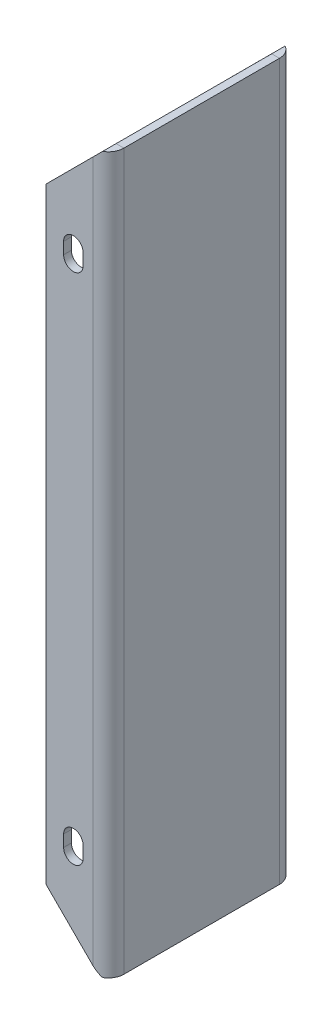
ISO-10303-21;
HEADER;
FILE_DESCRIPTION(('STEP AP214'),'2;1');
FILE_NAME('part.step','',(''),(''),'','','');
FILE_SCHEMA(('AUTOMOTIVE_DESIGN { 1 0 10303 214 1 1 1 1 }'));
ENDSEC;
DATA;
#1=APPLICATION_CONTEXT('core data for automotive mechanical design processes');
#2=APPLICATION_PROTOCOL_DEFINITION('international standard','automotive_design',2000,#1);
#3=PRODUCT_CONTEXT('',#1,'mechanical');
#4=PRODUCT('Part','Part','',(#3));
#5=PRODUCT_RELATED_PRODUCT_CATEGORY('part','',(#4));
#6=PRODUCT_DEFINITION_FORMATION('','',#4);
#7=PRODUCT_DEFINITION_CONTEXT('part definition',#1,'design');
#8=PRODUCT_DEFINITION('design','',#6,#7);
#9=PRODUCT_DEFINITION_SHAPE('','',#8);
#10=(LENGTH_UNIT() NAMED_UNIT(*) SI_UNIT(.MILLI.,.METRE.));
#11=(NAMED_UNIT(*) PLANE_ANGLE_UNIT() SI_UNIT($,.RADIAN.));
#12=(NAMED_UNIT(*) SI_UNIT($,.STERADIAN.) SOLID_ANGLE_UNIT());
#13=UNCERTAINTY_MEASURE_WITH_UNIT(LENGTH_MEASURE(1.E-05),#10,'distance_accuracy_value','');
#14=(GEOMETRIC_REPRESENTATION_CONTEXT(3) GLOBAL_UNCERTAINTY_ASSIGNED_CONTEXT((#13)) GLOBAL_UNIT_ASSIGNED_CONTEXT((#10,
#11,#12)) REPRESENTATION_CONTEXT('',''));
#15=CARTESIAN_POINT('',(0.,0.,0.));
#16=DIRECTION('',(0.,0.,1.));
#17=DIRECTION('',(1.,0.,0.));
#18=AXIS2_PLACEMENT_3D('',#15,#16,#17);
#19=CARTESIAN_POINT('',(38.1,584.2,0.));
#20=DIRECTION('',(0.,1.,0.));
#21=DIRECTION('',(0.,0.,1.));
#22=AXIS2_PLACEMENT_3D('',#19,#20,#21);
#23=PLANE('',#22);
#24=DIRECTION('',(0.,0.,-1.));
#25=VECTOR('',#24,1.);
#26=CARTESIAN_POINT('',(44.4246,584.2,0.));
#27=LINE('',#26,#25);
#28=CARTESIAN_POINT('',(44.4246,584.2,-1.68685172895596));
#29=VERTEX_POINT('',#28);
#30=CARTESIAN_POINT('',(44.4246,584.2,-12.1326069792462));
#31=VERTEX_POINT('',#30);
#32=EDGE_CURVE('E393',#29,#31,#27,.T.);
#33=ORIENTED_EDGE('',*,*,#32,.F.);
#34=CARTESIAN_POINT('',(38.1,584.2,-12.7));
#35=DIRECTION('',(0.,-1.,0.));
#36=DIRECTION('',(0.,0.,-1.));
#37=AXIS2_PLACEMENT_3D('',#34,#35,#36);
#38=CIRCLE('',#37,12.7);
#39=CARTESIAN_POINT('',(50.8,584.2,-12.7));
#40=VERTEX_POINT('',#39);
#41=EDGE_CURVE('E324',#29,#40,#38,.F.);
#42=ORIENTED_EDGE('',*,*,#41,.T.);
#43=DIRECTION('',(1.,0.,0.));
#44=VECTOR('',#43,1.);
#45=CARTESIAN_POINT('',(44.45,584.2,-12.7));
#46=LINE('',#45,#44);
#47=CARTESIAN_POINT('',(44.45,584.2,-12.7));
#48=VERTEX_POINT('',#47);
#49=EDGE_CURVE('E298',#48,#40,#46,.T.);
#50=ORIENTED_EDGE('',*,*,#49,.F.);
#51=CARTESIAN_POINT('',(38.1,584.2,-12.7));
#52=DIRECTION('',(0.,1.,0.));
#53=DIRECTION('',(1.,0.,0.));
#54=AXIS2_PLACEMENT_3D('',#51,#52,#53);
#55=CIRCLE('',#54,6.35);
#56=EDGE_CURVE('E517',#31,#48,#55,.T.);
#57=ORIENTED_EDGE('',*,*,#56,.F.);
#58=EDGE_LOOP('',(#33,#42,#50,#57));
#59=FACE_BOUND('',#58,.T.);
#60=ADVANCED_FACE('F36',(#59),#23,.T.);
#61=CARTESIAN_POINT('',(50.8,0.,-12.7));
#62=DIRECTION('',(0.,-1.,0.));
#63=DIRECTION('',(0.,0.,-1.));
#64=AXIS2_PLACEMENT_3D('',#61,#62,#63);
#65=PLANE('',#64);
#66=DIRECTION('',(0.,0.,-1.));
#67=VECTOR('',#66,1.);
#68=CARTESIAN_POINT('',(44.4246,0.,0.));
#69=LINE('',#68,#67);
#70=CARTESIAN_POINT('',(44.4246,0.,-1.68685172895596));
#71=VERTEX_POINT('',#70);
#72=CARTESIAN_POINT('',(44.4246,0.,-12.1326069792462));
#73=VERTEX_POINT('',#72);
#74=EDGE_CURVE('E50',#71,#73,#69,.T.);
#75=ORIENTED_EDGE('',*,*,#74,.T.);
#76=CARTESIAN_POINT('',(38.1,0.,-12.7));
#77=DIRECTION('',(0.,1.,0.));
#78=DIRECTION('',(1.,0.,0.));
#79=AXIS2_PLACEMENT_3D('',#76,#77,#78);
#80=CIRCLE('',#79,6.35);
#81=CARTESIAN_POINT('',(44.45,0.,-12.7));
#82=VERTEX_POINT('',#81);
#83=EDGE_CURVE('E335',#73,#82,#80,.T.);
#84=ORIENTED_EDGE('',*,*,#83,.T.);
#85=DIRECTION('',(-1.,0.,0.));
#86=VECTOR('',#85,1.);
#87=CARTESIAN_POINT('',(50.8,0.,-12.7));
#88=LINE('',#87,#86);
#89=CARTESIAN_POINT('',(50.8,0.,-12.7));
#90=VERTEX_POINT('',#89);
#91=EDGE_CURVE('E295',#90,#82,#88,.T.);
#92=ORIENTED_EDGE('',*,*,#91,.F.);
#93=CARTESIAN_POINT('',(38.1,0.,-12.7));
#94=DIRECTION('',(0.,-1.,0.));
#95=DIRECTION('',(0.,0.,-1.));
#96=AXIS2_PLACEMENT_3D('',#93,#94,#95);
#97=CIRCLE('',#96,12.7);
#98=EDGE_CURVE('E337',#71,#90,#97,.F.);
#99=ORIENTED_EDGE('',*,*,#98,.F.);
#100=EDGE_LOOP('',(#75,#84,#92,#99));
#101=FACE_BOUND('',#100,.T.);
#102=ADVANCED_FACE('F550',(#101),#65,.T.);
#103=CARTESIAN_POINT('',(38.1,0.,-6.35));
#104=DIRECTION('',(0.,-1.,0.));
#105=DIRECTION('',(0.,0.,-1.));
#106=AXIS2_PLACEMENT_3D('',#103,#104,#105);
#107=PLANE('',#106);
#108=DIRECTION('',(0.,0.,-1.));
#109=VECTOR('',#108,1.);
#110=CARTESIAN_POINT('',(50.8,0.,0.));
#111=LINE('',#110,#109);
#112=CARTESIAN_POINT('',(50.8,0.,-139.7));
#113=VERTEX_POINT('',#112);
#114=EDGE_CURVE('E339',#90,#113,#111,.T.);
#115=ORIENTED_EDGE('',*,*,#114,.F.);
#116=ORIENTED_EDGE('',*,*,#91,.T.);
#117=DIRECTION('',(0.,0.,-1.));
#118=VECTOR('',#117,1.);
#119=CARTESIAN_POINT('',(44.45,0.,0.));
#120=LINE('',#119,#118);
#121=CARTESIAN_POINT('',(44.45,0.,-139.7));
#122=VERTEX_POINT('',#121);
#123=EDGE_CURVE('E331',#82,#122,#120,.T.);
#124=ORIENTED_EDGE('',*,*,#123,.T.);
#125=DIRECTION('',(1.,0.,0.));
#126=VECTOR('',#125,1.);
#127=CARTESIAN_POINT('',(44.45,0.,-139.7));
#128=LINE('',#127,#126);
#129=EDGE_CURVE('E291',#122,#113,#128,.T.);
#130=ORIENTED_EDGE('',*,*,#129,.T.);
#131=EDGE_LOOP('',(#115,#116,#124,#130));
#132=FACE_BOUND('',#131,.T.);
#133=ADVANCED_FACE('F355',(#132),#107,.T.);
#134=CARTESIAN_POINT('',(50.8,584.2,-139.7));
#135=DIRECTION('',(0.,1.,0.));
#136=DIRECTION('',(0.,0.,1.));
#137=AXIS2_PLACEMENT_3D('',#134,#135,#136);
#138=PLANE('',#137);
#139=CARTESIAN_POINT('',(44.4246,584.2,-140.267393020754));
#140=VERTEX_POINT('',#139);
#141=CARTESIAN_POINT('',(44.4246,584.2,-150.713148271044));
#142=VERTEX_POINT('',#141);
#143=EDGE_CURVE('E317',#140,#142,#27,.T.);
#144=ORIENTED_EDGE('',*,*,#143,.F.);
#145=CARTESIAN_POINT('',(38.1,584.2,-139.7));
#146=DIRECTION('',(0.,1.,0.));
#147=DIRECTION('',(1.,0.,0.));
#148=AXIS2_PLACEMENT_3D('',#145,#146,#147);
#149=CIRCLE('',#148,6.35);
#150=CARTESIAN_POINT('',(44.45,584.2,-139.7));
#151=VERTEX_POINT('',#150);
#152=EDGE_CURVE('E343',#151,#140,#149,.T.);
#153=ORIENTED_EDGE('',*,*,#152,.F.);
#154=DIRECTION('',(-1.,0.,0.));
#155=VECTOR('',#154,1.);
#156=CARTESIAN_POINT('',(50.8,584.2,-139.7));
#157=LINE('',#156,#155);
#158=CARTESIAN_POINT('',(50.8,584.2,-139.7));
#159=VERTEX_POINT('',#158);
#160=EDGE_CURVE('E293',#159,#151,#157,.T.);
#161=ORIENTED_EDGE('',*,*,#160,.F.);
#162=CARTESIAN_POINT('',(38.1,584.2,-139.7));
#163=DIRECTION('',(0.,-1.,0.));
#164=DIRECTION('',(0.,0.,-1.));
#165=AXIS2_PLACEMENT_3D('',#162,#163,#164);
#166=CIRCLE('',#165,12.7);
#167=EDGE_CURVE('E308',#159,#142,#166,.F.);
#168=ORIENTED_EDGE('',*,*,#167,.T.);
#169=EDGE_LOOP('',(#144,#153,#161,#168));
#170=FACE_BOUND('',#169,.T.);
#171=ADVANCED_FACE('F315',(#170),#138,.T.);
#172=CARTESIAN_POINT('',(38.1,584.2,-146.05));
#173=DIRECTION('',(0.,1.,0.));
#174=DIRECTION('',(0.,0.,1.));
#175=AXIS2_PLACEMENT_3D('',#172,#173,#174);
#176=PLANE('',#175);
#177=DIRECTION('',(0.,0.,-1.));
#178=VECTOR('',#177,1.);
#179=CARTESIAN_POINT('',(50.8,584.2,0.));
#180=LINE('',#179,#178);
#181=EDGE_CURVE('E320',#40,#159,#180,.T.);
#182=ORIENTED_EDGE('',*,*,#181,.T.);
#183=ORIENTED_EDGE('',*,*,#160,.T.);
#184=DIRECTION('',(0.,0.,-1.));
#185=VECTOR('',#184,1.);
#186=CARTESIAN_POINT('',(44.45,584.2,0.));
#187=LINE('',#186,#185);
#188=EDGE_CURVE('E369',#48,#151,#187,.T.);
#189=ORIENTED_EDGE('',*,*,#188,.F.);
#190=ORIENTED_EDGE('',*,*,#49,.T.);
#191=EDGE_LOOP('',(#182,#183,#189,#190));
#192=FACE_BOUND('',#191,.T.);
#193=ADVANCED_FACE('F523',(#192),#176,.T.);
#194=CARTESIAN_POINT('',(38.1,0.,-152.4));
#195=DIRECTION('',(0.,-1.,0.));
#196=DIRECTION('',(0.,0.,-1.));
#197=AXIS2_PLACEMENT_3D('',#194,#195,#196);
#198=PLANE('',#197);
#199=CARTESIAN_POINT('',(44.4246,0.,-140.267393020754));
#200=VERTEX_POINT('',#199);
#201=CARTESIAN_POINT('',(44.4246,0.,-150.713148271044));
#202=VERTEX_POINT('',#201);
#203=EDGE_CURVE('E261',#200,#202,#69,.T.);
#204=ORIENTED_EDGE('',*,*,#203,.T.);
#205=CARTESIAN_POINT('',(38.1,0.,-139.7));
#206=DIRECTION('',(0.,-1.,0.));
#207=DIRECTION('',(0.,0.,-1.));
#208=AXIS2_PLACEMENT_3D('',#205,#206,#207);
#209=CIRCLE('',#208,12.7);
#210=EDGE_CURVE('E342',#113,#202,#209,.F.);
#211=ORIENTED_EDGE('',*,*,#210,.F.);
#212=ORIENTED_EDGE('',*,*,#129,.F.);
#213=CARTESIAN_POINT('',(38.1,0.,-139.7));
#214=DIRECTION('',(0.,1.,0.));
#215=DIRECTION('',(1.,0.,0.));
#216=AXIS2_PLACEMENT_3D('',#213,#214,#215);
#217=CIRCLE('',#216,6.35);
#218=EDGE_CURVE('E328',#122,#200,#217,.T.);
#219=ORIENTED_EDGE('',*,*,#218,.T.);
#220=EDGE_LOOP('',(#204,#211,#212,#219));
#221=FACE_BOUND('',#220,.T.);
#222=ADVANCED_FACE('F361',(#221),#198,.T.);
#223=CARTESIAN_POINT('',(50.8,584.2,-152.4));
#224=DIRECTION('',(0.,0.,1.));
#225=DIRECTION('',(1.,0.,0.));
#226=AXIS2_PLACEMENT_3D('',#223,#224,#225);
#227=PLANE('',#226);
#228=DIRECTION('',(0.,-1.,0.));
#229=VECTOR('',#228,1.);
#230=CARTESIAN_POINT('',(30.1625000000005,506.4125,-152.4));
#231=LINE('',#230,#229);
#232=CARTESIAN_POINT('',(30.1625000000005,506.4125,-152.4));
#233=VERTEX_POINT('',#232);
#234=CARTESIAN_POINT('',(30.1625,496.8875,-152.4));
#235=VERTEX_POINT('',#234);
#236=EDGE_CURVE('E420',#233,#235,#231,.T.);
#237=ORIENTED_EDGE('',*,*,#236,.F.);
#238=CARTESIAN_POINT('',(22.2249999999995,506.4125,-152.4));
#239=DIRECTION('',(0.,0.,-1.));
#240=DIRECTION('',(-1.,0.,0.));
#241=AXIS2_PLACEMENT_3D('',#238,#239,#240);
#242=CIRCLE('',#241,7.93750000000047);
#243=CARTESIAN_POINT('',(14.2874999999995,506.4125,-152.4));
#244=VERTEX_POINT('',#243);
#245=EDGE_CURVE('E404',#244,#233,#242,.T.);
#246=ORIENTED_EDGE('',*,*,#245,.F.);
#247=DIRECTION('',(0.,1.,0.));
#248=VECTOR('',#247,1.);
#249=CARTESIAN_POINT('',(14.2874999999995,506.4125,-152.4));
#250=LINE('',#249,#248);
#251=CARTESIAN_POINT('',(14.2874999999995,496.8875,-152.4));
#252=VERTEX_POINT('',#251);
#253=EDGE_CURVE('E409',#252,#244,#250,.T.);
#254=ORIENTED_EDGE('',*,*,#253,.F.);
#255=CARTESIAN_POINT('',(22.2249999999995,496.8875,-152.4));
#256=DIRECTION('',(0.,0.,-1.));
#257=DIRECTION('',(-1.,0.,0.));
#258=AXIS2_PLACEMENT_3D('',#255,#256,#257);
#259=CIRCLE('',#258,7.93750000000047);
#260=EDGE_CURVE('E423',#235,#252,#259,.T.);
#261=ORIENTED_EDGE('',*,*,#260,.F.);
#262=EDGE_LOOP('',(#237,#246,#254,#261));
#263=FACE_BOUND('',#262,.T.);
#264=DIRECTION('',(0.,1.,0.));
#265=VECTOR('',#264,1.);
#266=CARTESIAN_POINT('',(14.2875,77.7874999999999,-152.4));
#267=LINE('',#266,#265);
#268=CARTESIAN_POINT('',(14.2875,77.7874999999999,-152.4));
#269=VERTEX_POINT('',#268);
#270=CARTESIAN_POINT('',(14.2875,87.3124999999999,-152.4));
#271=VERTEX_POINT('',#270);
#272=EDGE_CURVE('E476',#269,#271,#267,.T.);
#273=ORIENTED_EDGE('',*,*,#272,.F.);
#274=CARTESIAN_POINT('',(22.225,77.7874999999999,-152.4));
#275=DIRECTION('',(0.,0.,-1.));
#276=DIRECTION('',(-1.,0.,0.));
#277=AXIS2_PLACEMENT_3D('',#274,#275,#276);
#278=CIRCLE('',#277,7.9375);
#279=CARTESIAN_POINT('',(30.1625,77.7874999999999,-152.4));
#280=VERTEX_POINT('',#279);
#281=EDGE_CURVE('E460',#280,#269,#278,.T.);
#282=ORIENTED_EDGE('',*,*,#281,.F.);
#283=DIRECTION('',(0.,-1.,0.));
#284=VECTOR('',#283,1.);
#285=CARTESIAN_POINT('',(30.1625,77.7874999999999,-152.4));
#286=LINE('',#285,#284);
#287=CARTESIAN_POINT('',(30.1625,87.3124999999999,-152.4));
#288=VERTEX_POINT('',#287);
#289=EDGE_CURVE('E465',#288,#280,#286,.T.);
#290=ORIENTED_EDGE('',*,*,#289,.F.);
#291=CARTESIAN_POINT('',(22.225,87.3124999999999,-152.4));
#292=DIRECTION('',(0.,0.,-1.));
#293=DIRECTION('',(-1.,0.,0.));
#294=AXIS2_PLACEMENT_3D('',#291,#292,#293);
#295=CIRCLE('',#294,7.9375);
#296=EDGE_CURVE('E479',#271,#288,#295,.T.);
#297=ORIENTED_EDGE('',*,*,#296,.F.);
#298=EDGE_LOOP('',(#273,#282,#290,#297));
#299=FACE_BOUND('',#298,.T.);
#300=DIRECTION('',(0.,-1.,0.));
#301=VECTOR('',#300,1.);
#302=CARTESIAN_POINT('',(38.1,584.2,-152.4));
#303=LINE('',#302,#301);
#304=CARTESIAN_POINT('',(38.1,577.8754,-152.4));
#305=VERTEX_POINT('',#304);
#306=CARTESIAN_POINT('',(38.1,6.3245999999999,-152.4));
#307=VERTEX_POINT('',#306);
#308=EDGE_CURVE('E310',#305,#307,#303,.T.);
#309=ORIENTED_EDGE('',*,*,#308,.T.);
#310=DIRECTION('',(0.707106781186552,-0.707106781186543,0.));
#311=VECTOR('',#310,1.);
#312=CARTESIAN_POINT('',(44.4246,0.,-152.4));
#313=LINE('',#312,#311);
#314=CARTESIAN_POINT('',(0.,44.4245999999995,-152.4));
#315=VERTEX_POINT('',#314);
#316=EDGE_CURVE('E58',#315,#307,#313,.T.);
#317=ORIENTED_EDGE('',*,*,#316,.F.);
#318=DIRECTION('',(0.,-1.,0.));
#319=VECTOR('',#318,1.);
#320=CARTESIAN_POINT('',(0.,584.2,-152.4));
#321=LINE('',#320,#319);
#322=CARTESIAN_POINT('',(0.,539.7754,-152.4));
#323=VERTEX_POINT('',#322);
#324=EDGE_CURVE('E288',#323,#315,#321,.T.);
#325=ORIENTED_EDGE('',*,*,#324,.F.);
#326=DIRECTION('',(-0.707106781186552,-0.707106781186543,0.));
#327=VECTOR('',#326,1.);
#328=CARTESIAN_POINT('',(44.4246,584.2,-152.4));
#329=LINE('',#328,#327);
#330=EDGE_CURVE('E380',#305,#323,#329,.T.);
#331=ORIENTED_EDGE('',*,*,#330,.F.);
#332=EDGE_LOOP('',(#309,#317,#325,#331));
#333=FACE_BOUND('',#332,.T.);
#334=ADVANCED_FACE('F525',(#263,#299,#333),#227,.F.);
#335=CARTESIAN_POINT('',(0.,584.2,-146.05));
#336=DIRECTION('',(-1.,0.,0.));
#337=DIRECTION('',(0.,0.,1.));
#338=AXIS2_PLACEMENT_3D('',#335,#336,#337);
#339=PLANE('',#338);
#340=DIRECTION('',(0.,0.,-1.));
#341=VECTOR('',#340,1.);
#342=CARTESIAN_POINT('',(0.,44.4245999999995,0.));
#343=LINE('',#342,#341);
#344=CARTESIAN_POINT('',(0.,44.4245999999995,-146.05));
#345=VERTEX_POINT('',#344);
#346=EDGE_CURVE('E251',#345,#315,#343,.T.);
#347=ORIENTED_EDGE('',*,*,#346,.F.);
#348=DIRECTION('',(0.,-1.,0.));
#349=VECTOR('',#348,1.);
#350=CARTESIAN_POINT('',(0.,584.2,-146.05));
#351=LINE('',#350,#349);
#352=CARTESIAN_POINT('',(0.,539.7754,-146.05));
#353=VERTEX_POINT('',#352);
#354=EDGE_CURVE('E285',#353,#345,#351,.T.);
#355=ORIENTED_EDGE('',*,*,#354,.F.);
#356=DIRECTION('',(0.,0.,-1.));
#357=VECTOR('',#356,1.);
#358=CARTESIAN_POINT('',(0.,539.7754,0.));
#359=LINE('',#358,#357);
#360=EDGE_CURVE('E391',#353,#323,#359,.T.);
#361=ORIENTED_EDGE('',*,*,#360,.T.);
#362=ORIENTED_EDGE('',*,*,#324,.T.);
#363=EDGE_LOOP('',(#347,#355,#361,#362));
#364=FACE_BOUND('',#363,.T.);
#365=ADVANCED_FACE('F533',(#364),#339,.T.);
#366=CARTESIAN_POINT('',(50.8,584.2,-146.05));
#367=DIRECTION('',(0.,0.,1.));
#368=DIRECTION('',(1.,0.,0.));
#369=AXIS2_PLACEMENT_3D('',#366,#367,#368);
#370=PLANE('',#369);
#371=DIRECTION('',(-0.707106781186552,0.707106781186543,0.));
#372=VECTOR('',#371,1.);
#373=CARTESIAN_POINT('',(-244.4877,288.912299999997,-146.05));
#374=LINE('',#373,#372);
#375=CARTESIAN_POINT('',(38.1,6.3245999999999,-146.05));
#376=VERTEX_POINT('',#375);
#377=EDGE_CURVE('E377',#376,#345,#374,.T.);
#378=ORIENTED_EDGE('',*,*,#377,.F.);
#379=DIRECTION('',(0.,-1.,0.));
#380=VECTOR('',#379,1.);
#381=CARTESIAN_POINT('',(38.1,584.2,-146.05));
#382=LINE('',#381,#380);
#383=CARTESIAN_POINT('',(38.1,577.8754,-146.05));
#384=VERTEX_POINT('',#383);
#385=EDGE_CURVE('E282',#384,#376,#382,.T.);
#386=ORIENTED_EDGE('',*,*,#385,.F.);
#387=DIRECTION('',(0.707106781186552,0.707106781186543,0.));
#388=VECTOR('',#387,1.);
#389=CARTESIAN_POINT('',(47.6123,587.3877,-146.05));
#390=LINE('',#389,#388);
#391=EDGE_CURVE('E402',#353,#384,#390,.T.);
#392=ORIENTED_EDGE('',*,*,#391,.F.);
#393=ORIENTED_EDGE('',*,*,#354,.T.);
#394=EDGE_LOOP('',(#378,#386,#392,#393));
#395=FACE_BOUND('',#394,.T.);
#396=CARTESIAN_POINT('',(22.2249999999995,506.4125,-146.05));
#397=DIRECTION('',(0.,0.,1.));
#398=DIRECTION('',(1.,0.,0.));
#399=AXIS2_PLACEMENT_3D('',#396,#397,#398);
#400=CIRCLE('',#399,7.93750000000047);
#401=CARTESIAN_POINT('',(30.1625000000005,506.4125,-146.05));
#402=VERTEX_POINT('',#401);
#403=CARTESIAN_POINT('',(14.2874999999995,506.4125,-146.05));
#404=VERTEX_POINT('',#403);
#405=EDGE_CURVE('E458',#402,#404,#400,.T.);
#406=ORIENTED_EDGE('',*,*,#405,.F.);
#407=DIRECTION('',(0.,1.,0.));
#408=VECTOR('',#407,1.);
#409=CARTESIAN_POINT('',(30.1625000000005,584.2,-146.05));
#410=LINE('',#409,#408);
#411=CARTESIAN_POINT('',(30.1625000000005,496.8875,-146.05));
#412=VERTEX_POINT('',#411);
#413=EDGE_CURVE('E444',#412,#402,#410,.T.);
#414=ORIENTED_EDGE('',*,*,#413,.F.);
#415=CARTESIAN_POINT('',(22.2249999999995,496.8875,-146.05));
#416=DIRECTION('',(0.,0.,1.));
#417=DIRECTION('',(1.,0.,0.));
#418=AXIS2_PLACEMENT_3D('',#415,#416,#417);
#419=CIRCLE('',#418,7.93750000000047);
#420=CARTESIAN_POINT('',(14.2874999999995,496.8875,-146.05));
#421=VERTEX_POINT('',#420);
#422=EDGE_CURVE('E448',#421,#412,#419,.T.);
#423=ORIENTED_EDGE('',*,*,#422,.F.);
#424=DIRECTION('',(0.,-1.,0.));
#425=VECTOR('',#424,1.);
#426=CARTESIAN_POINT('',(14.2874999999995,584.2,-146.05));
#427=LINE('',#426,#425);
#428=EDGE_CURVE('E453',#404,#421,#427,.T.);
#429=ORIENTED_EDGE('',*,*,#428,.F.);
#430=EDGE_LOOP('',(#406,#414,#423,#429));
#431=FACE_BOUND('',#430,.T.);
#432=CARTESIAN_POINT('',(22.225,77.7874999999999,-146.05));
#433=DIRECTION('',(0.,0.,1.));
#434=DIRECTION('',(1.,0.,0.));
#435=AXIS2_PLACEMENT_3D('',#432,#433,#434);
#436=CIRCLE('',#435,7.9375);
#437=CARTESIAN_POINT('',(14.2875,77.7874999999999,-146.05));
#438=VERTEX_POINT('',#437);
#439=CARTESIAN_POINT('',(30.1625,77.7874999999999,-146.05));
#440=VERTEX_POINT('',#439);
#441=EDGE_CURVE('E332',#438,#440,#436,.T.);
#442=ORIENTED_EDGE('',*,*,#441,.F.);
#443=DIRECTION('',(0.,-1.,0.));
#444=VECTOR('',#443,1.);
#445=CARTESIAN_POINT('',(14.2875000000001,584.2,-146.05));
#446=LINE('',#445,#444);
#447=CARTESIAN_POINT('',(14.2875,87.3125,-146.05));
#448=VERTEX_POINT('',#447);
#449=EDGE_CURVE('E500',#448,#438,#446,.T.);
#450=ORIENTED_EDGE('',*,*,#449,.F.);
#451=CARTESIAN_POINT('',(22.225,87.3124999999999,-146.05));
#452=DIRECTION('',(0.,0.,1.));
#453=DIRECTION('',(1.,0.,0.));
#454=AXIS2_PLACEMENT_3D('',#451,#452,#453);
#455=CIRCLE('',#454,7.9375);
#456=CARTESIAN_POINT('',(30.1625,87.3124999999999,-146.05));
#457=VERTEX_POINT('',#456);
#458=EDGE_CURVE('E504',#457,#448,#455,.T.);
#459=ORIENTED_EDGE('',*,*,#458,.F.);
#460=DIRECTION('',(0.,1.,0.));
#461=VECTOR('',#460,1.);
#462=CARTESIAN_POINT('',(30.1625000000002,584.2,-146.05));
#463=LINE('',#462,#461);
#464=EDGE_CURVE('E509',#440,#457,#463,.T.);
#465=ORIENTED_EDGE('',*,*,#464,.F.);
#466=EDGE_LOOP('',(#442,#450,#459,#465));
#467=FACE_BOUND('',#466,.T.);
#468=ADVANCED_FACE('F581',(#395,#431,#467),#370,.T.);
#469=CARTESIAN_POINT('',(38.1,584.2,-139.7));
#470=DIRECTION('',(0.,-1.,0.));
#471=DIRECTION('',(0.,0.,-1.));
#472=AXIS2_PLACEMENT_3D('',#469,#470,#471);
#473=CYLINDRICAL_SURFACE('',#472,6.35);
#474=CARTESIAN_POINT('',(38.1,6.3245999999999,-139.7));
#475=DIRECTION('',(0.707106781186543,0.707106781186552,0.));
#476=DIRECTION('',(0.707106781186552,-0.707106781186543,0.));
#477=AXIS2_PLACEMENT_3D('',#474,#475,#476);
#478=ELLIPSE('',#477,8.9802561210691,6.35);
#479=EDGE_CURVE('E373',#200,#376,#478,.T.);
#480=ORIENTED_EDGE('',*,*,#479,.F.);
#481=ORIENTED_EDGE('',*,*,#218,.F.);
#482=DIRECTION('',(0.,-1.,0.));
#483=VECTOR('',#482,1.);
#484=CARTESIAN_POINT('',(44.45,584.2,-139.7));
#485=LINE('',#484,#483);
#486=EDGE_CURVE('E279',#151,#122,#485,.T.);
#487=ORIENTED_EDGE('',*,*,#486,.F.);
#488=ORIENTED_EDGE('',*,*,#152,.T.);
#489=CARTESIAN_POINT('',(38.1,577.8754,-139.7));
#490=DIRECTION('',(0.707106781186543,-0.707106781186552,0.));
#491=DIRECTION('',(-0.707106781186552,-0.707106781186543,0.));
#492=AXIS2_PLACEMENT_3D('',#489,#490,#491);
#493=ELLIPSE('',#492,8.9802561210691,6.35);
#494=EDGE_CURVE('E400',#384,#140,#493,.T.);
#495=ORIENTED_EDGE('',*,*,#494,.F.);
#496=ORIENTED_EDGE('',*,*,#385,.T.);
#497=EDGE_LOOP('',(#480,#481,#487,#488,#495,#496));
#498=FACE_BOUND('',#497,.T.);
#499=ADVANCED_FACE('F372',(#498),#473,.F.);
#500=CARTESIAN_POINT('',(44.45,584.2,0.));
#501=DIRECTION('',(-1.,0.,0.));
#502=DIRECTION('',(0.,0.,1.));
#503=AXIS2_PLACEMENT_3D('',#500,#501,#502);
#504=PLANE('',#503);
#505=ORIENTED_EDGE('',*,*,#123,.F.);
#506=DIRECTION('',(0.,-1.,0.));
#507=VECTOR('',#506,1.);
#508=CARTESIAN_POINT('',(44.45,584.2,-12.7));
#509=LINE('',#508,#507);
#510=EDGE_CURVE('E276',#48,#82,#509,.T.);
#511=ORIENTED_EDGE('',*,*,#510,.F.);
#512=ORIENTED_EDGE('',*,*,#188,.T.);
#513=ORIENTED_EDGE('',*,*,#486,.T.);
#514=EDGE_LOOP('',(#505,#511,#512,#513));
#515=FACE_BOUND('',#514,.T.);
#516=ADVANCED_FACE('F366',(#515),#504,.T.);
#517=CARTESIAN_POINT('',(38.1,584.2,-12.7));
#518=DIRECTION('',(0.,-1.,0.));
#519=DIRECTION('',(0.,0.,-1.));
#520=AXIS2_PLACEMENT_3D('',#517,#518,#519);
#521=CYLINDRICAL_SURFACE('',#520,6.35);
#522=CARTESIAN_POINT('',(38.1,6.3245999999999,-12.7));
#523=DIRECTION('',(0.707106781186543,0.707106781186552,0.));
#524=DIRECTION('',(0.707106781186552,-0.707106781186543,0.));
#525=AXIS2_PLACEMENT_3D('',#522,#523,#524);
#526=ELLIPSE('',#525,8.9802561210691,6.35);
#527=CARTESIAN_POINT('',(38.1,6.32460000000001,-6.35));
#528=VERTEX_POINT('',#527);
#529=EDGE_CURVE('E378',#528,#73,#526,.T.);
#530=ORIENTED_EDGE('',*,*,#529,.F.);
#531=DIRECTION('',(0.,-1.,0.));
#532=VECTOR('',#531,1.);
#533=CARTESIAN_POINT('',(38.1,584.2,-6.35));
#534=LINE('',#533,#532);
#535=CARTESIAN_POINT('',(38.1,577.8754,-6.35));
#536=VERTEX_POINT('',#535);
#537=EDGE_CURVE('E268',#536,#528,#534,.T.);
#538=ORIENTED_EDGE('',*,*,#537,.F.);
#539=CARTESIAN_POINT('',(38.1,577.8754,-12.7));
#540=DIRECTION('',(0.707106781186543,-0.707106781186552,0.));
#541=DIRECTION('',(-0.707106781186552,-0.707106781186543,0.));
#542=AXIS2_PLACEMENT_3D('',#539,#540,#541);
#543=ELLIPSE('',#542,8.9802561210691,6.35);
#544=EDGE_CURVE('E398',#31,#536,#543,.T.);
#545=ORIENTED_EDGE('',*,*,#544,.F.);
#546=ORIENTED_EDGE('',*,*,#56,.T.);
#547=ORIENTED_EDGE('',*,*,#510,.T.);
#548=ORIENTED_EDGE('',*,*,#83,.F.);
#549=EDGE_LOOP('',(#530,#538,#545,#546,#547,#548));
#550=FACE_BOUND('',#549,.T.);
#551=ADVANCED_FACE('F541',(#550),#521,.F.);
#552=CARTESIAN_POINT('',(0.,584.2,-6.35));
#553=DIRECTION('',(0.,0.,-1.));
#554=DIRECTION('',(-1.,0.,0.));
#555=AXIS2_PLACEMENT_3D('',#552,#553,#554);
#556=PLANE('',#555);
#557=DIRECTION('',(0.707106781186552,-0.707106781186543,0.));
#558=VECTOR('',#557,1.);
#559=CARTESIAN_POINT('',(-269.8877,314.312299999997,-6.35));
#560=LINE('',#559,#558);
#561=CARTESIAN_POINT('',(0.,44.4245999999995,-6.35));
#562=VERTEX_POINT('',#561);
#563=EDGE_CURVE('E382',#562,#528,#560,.T.);
#564=ORIENTED_EDGE('',*,*,#563,.F.);
#565=DIRECTION('',(0.,-1.,0.));
#566=VECTOR('',#565,1.);
#567=CARTESIAN_POINT('',(0.,584.2,-6.35));
#568=LINE('',#567,#566);
#569=CARTESIAN_POINT('',(0.,539.7754,-6.35));
#570=VERTEX_POINT('',#569);
#571=EDGE_CURVE('E260',#570,#562,#568,.T.);
#572=ORIENTED_EDGE('',*,*,#571,.F.);
#573=DIRECTION('',(-0.707106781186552,-0.707106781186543,0.));
#574=VECTOR('',#573,1.);
#575=CARTESIAN_POINT('',(22.2122999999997,561.9877,-6.35));
#576=LINE('',#575,#574);
#577=EDGE_CURVE('E396',#536,#570,#576,.T.);
#578=ORIENTED_EDGE('',*,*,#577,.F.);
#579=ORIENTED_EDGE('',*,*,#537,.T.);
#580=EDGE_LOOP('',(#564,#572,#578,#579));
#581=FACE_BOUND('',#580,.T.);
#582=CARTESIAN_POINT('',(22.2249999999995,506.4125,-6.35));
#583=DIRECTION('',(0.,0.,-1.));
#584=DIRECTION('',(-1.,0.,0.));
#585=AXIS2_PLACEMENT_3D('',#582,#583,#584);
#586=CIRCLE('',#585,7.93750000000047);
#587=CARTESIAN_POINT('',(14.2874999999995,506.4125,-6.35));
#588=VERTEX_POINT('',#587);
#589=CARTESIAN_POINT('',(30.1625000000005,506.4125,-6.35));
#590=VERTEX_POINT('',#589);
#591=EDGE_CURVE('E455',#588,#590,#586,.T.);
#592=ORIENTED_EDGE('',*,*,#591,.F.);
#593=DIRECTION('',(0.,1.,0.));
#594=VECTOR('',#593,1.);
#595=CARTESIAN_POINT('',(14.2874999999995,584.2,-6.35));
#596=LINE('',#595,#594);
#597=CARTESIAN_POINT('',(14.2874999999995,496.8875,-6.35));
#598=VERTEX_POINT('',#597);
#599=EDGE_CURVE('E451',#598,#588,#596,.T.);
#600=ORIENTED_EDGE('',*,*,#599,.F.);
#601=CARTESIAN_POINT('',(22.2249999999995,496.8875,-6.35));
#602=DIRECTION('',(0.,0.,-1.));
#603=DIRECTION('',(-1.,0.,0.));
#604=AXIS2_PLACEMENT_3D('',#601,#602,#603);
#605=CIRCLE('',#604,7.93750000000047);
#606=CARTESIAN_POINT('',(30.1625,496.8875,-6.35));
#607=VERTEX_POINT('',#606);
#608=EDGE_CURVE('E446',#607,#598,#605,.T.);
#609=ORIENTED_EDGE('',*,*,#608,.F.);
#610=DIRECTION('',(0.,-1.,0.));
#611=VECTOR('',#610,1.);
#612=CARTESIAN_POINT('',(30.1625000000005,584.2,-6.35));
#613=LINE('',#612,#611);
#614=EDGE_CURVE('E431',#590,#607,#613,.T.);
#615=ORIENTED_EDGE('',*,*,#614,.F.);
#616=EDGE_LOOP('',(#592,#600,#609,#615));
#617=FACE_BOUND('',#616,.T.);
#618=CARTESIAN_POINT('',(22.225,77.7874999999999,-6.35));
#619=DIRECTION('',(0.,0.,-1.));
#620=DIRECTION('',(-1.,0.,0.));
#621=AXIS2_PLACEMENT_3D('',#618,#619,#620);
#622=CIRCLE('',#621,7.9375);
#623=CARTESIAN_POINT('',(30.1625,77.7874999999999,-6.35));
#624=VERTEX_POINT('',#623);
#625=CARTESIAN_POINT('',(14.2875,77.7874999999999,-6.35));
#626=VERTEX_POINT('',#625);
#627=EDGE_CURVE('E511',#624,#626,#622,.T.);
#628=ORIENTED_EDGE('',*,*,#627,.F.);
#629=DIRECTION('',(0.,-1.,0.));
#630=VECTOR('',#629,1.);
#631=CARTESIAN_POINT('',(30.1625000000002,584.2,-6.35));
#632=LINE('',#631,#630);
#633=CARTESIAN_POINT('',(30.1625,87.3124999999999,-6.35));
#634=VERTEX_POINT('',#633);
#635=EDGE_CURVE('E507',#634,#624,#632,.T.);
#636=ORIENTED_EDGE('',*,*,#635,.F.);
#637=CARTESIAN_POINT('',(22.225,87.3124999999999,-6.35));
#638=DIRECTION('',(0.,0.,-1.));
#639=DIRECTION('',(-1.,0.,0.));
#640=AXIS2_PLACEMENT_3D('',#637,#638,#639);
#641=CIRCLE('',#640,7.9375);
#642=CARTESIAN_POINT('',(14.2875,87.3124999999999,-6.35));
#643=VERTEX_POINT('',#642);
#644=EDGE_CURVE('E502',#643,#634,#641,.T.);
#645=ORIENTED_EDGE('',*,*,#644,.F.);
#646=DIRECTION('',(0.,1.,0.));
#647=VECTOR('',#646,1.);
#648=CARTESIAN_POINT('',(14.2875000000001,584.2,-6.35));
#649=LINE('',#648,#647);
#650=EDGE_CURVE('E487',#626,#643,#649,.T.);
#651=ORIENTED_EDGE('',*,*,#650,.F.);
#652=EDGE_LOOP('',(#628,#636,#645,#651));
#653=FACE_BOUND('',#652,.T.);
#654=ADVANCED_FACE('F544',(#581,#617,#653),#556,.T.);
#655=CARTESIAN_POINT('',(0.,584.2,0.));
#656=DIRECTION('',(-1.,0.,0.));
#657=DIRECTION('',(0.,0.,1.));
#658=AXIS2_PLACEMENT_3D('',#655,#656,#657);
#659=PLANE('',#658);
#660=CARTESIAN_POINT('',(0.,44.4245999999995,0.));
#661=VERTEX_POINT('',#660);
#662=EDGE_CURVE('E244',#661,#562,#343,.T.);
#663=ORIENTED_EDGE('',*,*,#662,.F.);
#664=DIRECTION('',(0.,-1.,0.));
#665=VECTOR('',#664,1.);
#666=CARTESIAN_POINT('',(0.,584.2,0.));
#667=LINE('',#666,#665);
#668=CARTESIAN_POINT('',(0.,539.7754,0.));
#669=VERTEX_POINT('',#668);
#670=EDGE_CURVE('E258',#669,#661,#667,.T.);
#671=ORIENTED_EDGE('',*,*,#670,.F.);
#672=EDGE_CURVE('E388',#669,#570,#359,.T.);
#673=ORIENTED_EDGE('',*,*,#672,.T.);
#674=ORIENTED_EDGE('',*,*,#571,.T.);
#675=EDGE_LOOP('',(#663,#671,#673,#674));
#676=FACE_BOUND('',#675,.T.);
#677=ADVANCED_FACE('F256',(#676),#659,.T.);
#678=CARTESIAN_POINT('',(0.,584.2,0.));
#679=DIRECTION('',(0.,0.,-1.));
#680=DIRECTION('',(-1.,0.,0.));
#681=AXIS2_PLACEMENT_3D('',#678,#679,#680);
#682=PLANE('',#681);
#683=DIRECTION('',(0.,1.,0.));
#684=VECTOR('',#683,1.);
#685=CARTESIAN_POINT('',(14.2874999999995,506.4125,0.));
#686=LINE('',#685,#684);
#687=CARTESIAN_POINT('',(14.2874999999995,496.8875,0.));
#688=VERTEX_POINT('',#687);
#689=CARTESIAN_POINT('',(14.2874999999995,506.4125,0.));
#690=VERTEX_POINT('',#689);
#691=EDGE_CURVE('E415',#688,#690,#686,.T.);
#692=ORIENTED_EDGE('',*,*,#691,.T.);
#693=CARTESIAN_POINT('',(22.2249999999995,506.4125,0.));
#694=DIRECTION('',(0.,0.,-1.));
#695=DIRECTION('',(-1.,0.,0.));
#696=AXIS2_PLACEMENT_3D('',#693,#694,#695);
#697=CIRCLE('',#696,7.93750000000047);
#698=CARTESIAN_POINT('',(30.1625000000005,506.4125,0.));
#699=VERTEX_POINT('',#698);
#700=EDGE_CURVE('E405',#690,#699,#697,.T.);
#701=ORIENTED_EDGE('',*,*,#700,.T.);
#702=DIRECTION('',(0.,-1.,0.));
#703=VECTOR('',#702,1.);
#704=CARTESIAN_POINT('',(30.1625000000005,506.4125,0.));
#705=LINE('',#704,#703);
#706=CARTESIAN_POINT('',(30.1625000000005,496.8875,0.));
#707=VERTEX_POINT('',#706);
#708=EDGE_CURVE('E408',#699,#707,#705,.T.);
#709=ORIENTED_EDGE('',*,*,#708,.T.);
#710=CARTESIAN_POINT('',(22.2249999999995,496.8875,0.));
#711=DIRECTION('',(0.,0.,-1.));
#712=DIRECTION('',(-1.,0.,0.));
#713=AXIS2_PLACEMENT_3D('',#710,#711,#712);
#714=CIRCLE('',#713,7.93750000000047);
#715=EDGE_CURVE('E412',#707,#688,#714,.T.);
#716=ORIENTED_EDGE('',*,*,#715,.T.);
#717=EDGE_LOOP('',(#692,#701,#709,#716));
#718=FACE_BOUND('',#717,.T.);
#719=DIRECTION('',(0.,-1.,0.));
#720=VECTOR('',#719,1.);
#721=CARTESIAN_POINT('',(30.1625,77.7874999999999,0.));
#722=LINE('',#721,#720);
#723=CARTESIAN_POINT('',(30.1625,87.3124999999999,0.));
#724=VERTEX_POINT('',#723);
#725=CARTESIAN_POINT('',(30.1625,77.7874999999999,0.));
#726=VERTEX_POINT('',#725);
#727=EDGE_CURVE('E471',#724,#726,#722,.T.);
#728=ORIENTED_EDGE('',*,*,#727,.T.);
#729=CARTESIAN_POINT('',(22.225,77.7874999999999,0.));
#730=DIRECTION('',(0.,0.,-1.));
#731=DIRECTION('',(-1.,0.,0.));
#732=AXIS2_PLACEMENT_3D('',#729,#730,#731);
#733=CIRCLE('',#732,7.9375);
#734=CARTESIAN_POINT('',(14.2875,77.7874999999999,0.));
#735=VERTEX_POINT('',#734);
#736=EDGE_CURVE('E461',#726,#735,#733,.T.);
#737=ORIENTED_EDGE('',*,*,#736,.T.);
#738=DIRECTION('',(0.,1.,0.));
#739=VECTOR('',#738,1.);
#740=CARTESIAN_POINT('',(14.2875,77.7874999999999,0.));
#741=LINE('',#740,#739);
#742=CARTESIAN_POINT('',(14.2875,87.3125,0.));
#743=VERTEX_POINT('',#742);
#744=EDGE_CURVE('E464',#735,#743,#741,.T.);
#745=ORIENTED_EDGE('',*,*,#744,.T.);
#746=CARTESIAN_POINT('',(22.225,87.3124999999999,0.));
#747=DIRECTION('',(0.,0.,-1.));
#748=DIRECTION('',(-1.,0.,0.));
#749=AXIS2_PLACEMENT_3D('',#746,#747,#748);
#750=CIRCLE('',#749,7.9375);
#751=EDGE_CURVE('E468',#743,#724,#750,.T.);
#752=ORIENTED_EDGE('',*,*,#751,.T.);
#753=EDGE_LOOP('',(#728,#737,#745,#752));
#754=FACE_BOUND('',#753,.T.);
#755=ORIENTED_EDGE('',*,*,#670,.T.);
#756=DIRECTION('',(0.707106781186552,-0.707106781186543,0.));
#757=VECTOR('',#756,1.);
#758=CARTESIAN_POINT('',(44.4246,0.,0.));
#759=LINE('',#758,#757);
#760=CARTESIAN_POINT('',(38.1,6.3245999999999,0.));
#761=VERTEX_POINT('',#760);
#762=EDGE_CURVE('E241',#661,#761,#759,.T.);
#763=ORIENTED_EDGE('',*,*,#762,.T.);
#764=DIRECTION('',(0.,-1.,0.));
#765=VECTOR('',#764,1.);
#766=CARTESIAN_POINT('',(38.1,584.2,0.));
#767=LINE('',#766,#765);
#768=CARTESIAN_POINT('',(38.1,577.8754,0.));
#769=VERTEX_POINT('',#768);
#770=EDGE_CURVE('E266',#769,#761,#767,.T.);
#771=ORIENTED_EDGE('',*,*,#770,.F.);
#772=DIRECTION('',(-0.707106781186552,-0.707106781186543,0.));
#773=VECTOR('',#772,1.);
#774=CARTESIAN_POINT('',(44.4246,584.2,0.));
#775=LINE('',#774,#773);
#776=EDGE_CURVE('E265',#769,#669,#775,.T.);
#777=ORIENTED_EDGE('',*,*,#776,.T.);
#778=EDGE_LOOP('',(#755,#763,#771,#777));
#779=FACE_BOUND('',#778,.T.);
#780=ADVANCED_FACE('F264',(#718,#754,#779),#682,.F.);
#781=CARTESIAN_POINT('',(38.1,584.2,-12.7));
#782=DIRECTION('',(0.,-1.,0.));
#783=DIRECTION('',(0.,0.,-1.));
#784=AXIS2_PLACEMENT_3D('',#781,#782,#783);
#785=CYLINDRICAL_SURFACE('',#784,12.7);
#786=ORIENTED_EDGE('',*,*,#770,.T.);
#787=CARTESIAN_POINT('',(38.1,6.3245999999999,-12.7));
#788=DIRECTION('',(0.707106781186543,0.707106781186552,0.));
#789=DIRECTION('',(0.707106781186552,-0.707106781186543,0.));
#790=AXIS2_PLACEMENT_3D('',#787,#788,#789);
#791=ELLIPSE('',#790,17.9605122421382,12.7);
#792=EDGE_CURVE('E246',#761,#71,#791,.T.);
#793=ORIENTED_EDGE('',*,*,#792,.T.);
#794=ORIENTED_EDGE('',*,*,#98,.T.);
#795=DIRECTION('',(0.,-1.,0.));
#796=VECTOR('',#795,1.);
#797=CARTESIAN_POINT('',(50.8,584.2,-12.7));
#798=LINE('',#797,#796);
#799=EDGE_CURVE('E270',#40,#90,#798,.T.);
#800=ORIENTED_EDGE('',*,*,#799,.F.);
#801=ORIENTED_EDGE('',*,*,#41,.F.);
#802=CARTESIAN_POINT('',(38.1,577.8754,-12.7));
#803=DIRECTION('',(0.707106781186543,-0.707106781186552,0.));
#804=DIRECTION('',(-0.707106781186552,-0.707106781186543,0.));
#805=AXIS2_PLACEMENT_3D('',#802,#803,#804);
#806=ELLIPSE('',#805,17.9605122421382,12.7);
#807=EDGE_CURVE('E390',#29,#769,#806,.T.);
#808=ORIENTED_EDGE('',*,*,#807,.T.);
#809=EDGE_LOOP('',(#786,#793,#794,#800,#801,#808));
#810=FACE_BOUND('',#809,.T.);
#811=ADVANCED_FACE('F546',(#810),#785,.T.);
#812=CARTESIAN_POINT('',(50.8,584.2,0.));
#813=DIRECTION('',(-1.,0.,0.));
#814=DIRECTION('',(0.,0.,1.));
#815=AXIS2_PLACEMENT_3D('',#812,#813,#814);
#816=PLANE('',#815);
#817=ORIENTED_EDGE('',*,*,#114,.T.);
#818=DIRECTION('',(0.,-1.,0.));
#819=VECTOR('',#818,1.);
#820=CARTESIAN_POINT('',(50.8,584.2,-139.7));
#821=LINE('',#820,#819);
#822=EDGE_CURVE('E322',#159,#113,#821,.T.);
#823=ORIENTED_EDGE('',*,*,#822,.F.);
#824=ORIENTED_EDGE('',*,*,#181,.F.);
#825=ORIENTED_EDGE('',*,*,#799,.T.);
#826=EDGE_LOOP('',(#817,#823,#824,#825));
#827=FACE_BOUND('',#826,.T.);
#828=ADVANCED_FACE('F350',(#827),#816,.F.);
#829=CARTESIAN_POINT('',(38.1,584.2,-139.7));
#830=DIRECTION('',(0.,-1.,0.));
#831=DIRECTION('',(0.,0.,-1.));
#832=AXIS2_PLACEMENT_3D('',#829,#830,#831);
#833=CYLINDRICAL_SURFACE('',#832,12.7);
#834=ORIENTED_EDGE('',*,*,#210,.T.);
#835=CARTESIAN_POINT('',(38.1,6.3245999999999,-139.7));
#836=DIRECTION('',(0.707106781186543,0.707106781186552,0.));
#837=DIRECTION('',(0.707106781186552,-0.707106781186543,0.));
#838=AXIS2_PLACEMENT_3D('',#835,#836,#837);
#839=ELLIPSE('',#838,17.9605122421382,12.7);
#840=EDGE_CURVE('E11',#202,#307,#839,.T.);
#841=ORIENTED_EDGE('',*,*,#840,.T.);
#842=ORIENTED_EDGE('',*,*,#308,.F.);
#843=CARTESIAN_POINT('',(38.1,577.8754,-139.7));
#844=DIRECTION('',(0.707106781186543,-0.707106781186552,0.));
#845=DIRECTION('',(-0.707106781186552,-0.707106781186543,0.));
#846=AXIS2_PLACEMENT_3D('',#843,#844,#845);
#847=ELLIPSE('',#846,17.9605122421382,12.7);
#848=EDGE_CURVE('E43',#305,#142,#847,.T.);
#849=ORIENTED_EDGE('',*,*,#848,.T.);
#850=ORIENTED_EDGE('',*,*,#167,.F.);
#851=ORIENTED_EDGE('',*,*,#822,.T.);
#852=EDGE_LOOP('',(#834,#841,#842,#849,#850,#851));
#853=FACE_BOUND('',#852,.T.);
#854=ADVANCED_FACE('F306',(#853),#833,.T.);
#855=CARTESIAN_POINT('',(14.2875,77.7874999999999,0.));
#856=DIRECTION('',(-1.,0.,0.));
#857=DIRECTION('',(0.,-1.,0.));
#858=AXIS2_PLACEMENT_3D('',#855,#856,#857);
#859=PLANE('',#858);
#860=ORIENTED_EDGE('',*,*,#650,.T.);
#861=DIRECTION('',(0.,0.,-1.));
#862=VECTOR('',#861,1.);
#863=CARTESIAN_POINT('',(14.2875,87.3124999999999,0.));
#864=LINE('',#863,#862);
#865=EDGE_CURVE('E493',#743,#643,#864,.T.);
#866=ORIENTED_EDGE('',*,*,#865,.F.);
#867=ORIENTED_EDGE('',*,*,#744,.F.);
#868=DIRECTION('',(0.,0.,-1.));
#869=VECTOR('',#868,1.);
#870=CARTESIAN_POINT('',(14.2875,77.7874999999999,0.));
#871=LINE('',#870,#869);
#872=EDGE_CURVE('E497',#735,#626,#871,.T.);
#873=ORIENTED_EDGE('',*,*,#872,.T.);
#874=EDGE_LOOP('',(#860,#866,#867,#873));
#875=FACE_BOUND('',#874,.T.);
#876=ADVANCED_FACE('F604',(#875),#859,.F.);
#877=CARTESIAN_POINT('',(22.225,87.3124999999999,0.));
#878=DIRECTION('',(0.,0.,-1.));
#879=DIRECTION('',(-1.,0.,0.));
#880=AXIS2_PLACEMENT_3D('',#877,#878,#879);
#881=CYLINDRICAL_SURFACE('',#880,7.9375);
#882=ORIENTED_EDGE('',*,*,#644,.T.);
#883=DIRECTION('',(0.,0.,-1.));
#884=VECTOR('',#883,1.);
#885=CARTESIAN_POINT('',(30.1625,87.3124999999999,0.));
#886=LINE('',#885,#884);
#887=EDGE_CURVE('E489',#724,#634,#886,.T.);
#888=ORIENTED_EDGE('',*,*,#887,.F.);
#889=ORIENTED_EDGE('',*,*,#751,.F.);
#890=ORIENTED_EDGE('',*,*,#865,.T.);
#891=EDGE_LOOP('',(#882,#888,#889,#890));
#892=FACE_BOUND('',#891,.T.);
#893=ADVANCED_FACE('F613',(#892),#881,.F.);
#894=CARTESIAN_POINT('',(30.1625,77.7874999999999,0.));
#895=DIRECTION('',(1.,0.,0.));
#896=DIRECTION('',(0.,1.,0.));
#897=AXIS2_PLACEMENT_3D('',#894,#895,#896);
#898=PLANE('',#897);
#899=ORIENTED_EDGE('',*,*,#635,.T.);
#900=DIRECTION('',(0.,0.,-1.));
#901=VECTOR('',#900,1.);
#902=CARTESIAN_POINT('',(30.1625,77.7874999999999,0.));
#903=LINE('',#902,#901);
#904=EDGE_CURVE('E484',#726,#624,#903,.T.);
#905=ORIENTED_EDGE('',*,*,#904,.F.);
#906=ORIENTED_EDGE('',*,*,#727,.F.);
#907=ORIENTED_EDGE('',*,*,#887,.T.);
#908=EDGE_LOOP('',(#899,#905,#906,#907));
#909=FACE_BOUND('',#908,.T.);
#910=ADVANCED_FACE('F609',(#909),#898,.F.);
#911=CARTESIAN_POINT('',(22.225,77.7874999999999,0.));
#912=DIRECTION('',(0.,0.,-1.));
#913=DIRECTION('',(-1.,0.,0.));
#914=AXIS2_PLACEMENT_3D('',#911,#912,#913);
#915=CYLINDRICAL_SURFACE('',#914,7.9375);
#916=ORIENTED_EDGE('',*,*,#627,.T.);
#917=ORIENTED_EDGE('',*,*,#872,.F.);
#918=ORIENTED_EDGE('',*,*,#736,.F.);
#919=ORIENTED_EDGE('',*,*,#904,.T.);
#920=EDGE_LOOP('',(#916,#917,#918,#919));
#921=FACE_BOUND('',#920,.T.);
#922=ADVANCED_FACE('F605',(#921),#915,.F.);
#923=ORIENTED_EDGE('',*,*,#441,.T.);
#924=EDGE_CURVE('E488',#440,#280,#903,.T.);
#925=ORIENTED_EDGE('',*,*,#924,.T.);
#926=ORIENTED_EDGE('',*,*,#281,.T.);
#927=EDGE_CURVE('E474',#438,#269,#871,.T.);
#928=ORIENTED_EDGE('',*,*,#927,.F.);
#929=EDGE_LOOP('',(#923,#925,#926,#928));
#930=FACE_BOUND('',#929,.T.);
#931=ADVANCED_FACE('F608',(#930),#915,.F.);
#932=ORIENTED_EDGE('',*,*,#464,.T.);
#933=EDGE_CURVE('E492',#457,#288,#886,.T.);
#934=ORIENTED_EDGE('',*,*,#933,.T.);
#935=ORIENTED_EDGE('',*,*,#289,.T.);
#936=ORIENTED_EDGE('',*,*,#924,.F.);
#937=EDGE_LOOP('',(#932,#934,#935,#936));
#938=FACE_BOUND('',#937,.T.);
#939=ADVANCED_FACE('F623',(#938),#898,.F.);
#940=ORIENTED_EDGE('',*,*,#458,.T.);
#941=EDGE_CURVE('E496',#448,#271,#864,.T.);
#942=ORIENTED_EDGE('',*,*,#941,.T.);
#943=ORIENTED_EDGE('',*,*,#296,.T.);
#944=ORIENTED_EDGE('',*,*,#933,.F.);
#945=EDGE_LOOP('',(#940,#942,#943,#944));
#946=FACE_BOUND('',#945,.T.);
#947=ADVANCED_FACE('F619',(#946),#881,.F.);
#948=ORIENTED_EDGE('',*,*,#449,.T.);
#949=ORIENTED_EDGE('',*,*,#927,.T.);
#950=ORIENTED_EDGE('',*,*,#272,.T.);
#951=ORIENTED_EDGE('',*,*,#941,.F.);
#952=EDGE_LOOP('',(#948,#949,#950,#951));
#953=FACE_BOUND('',#952,.T.);
#954=ADVANCED_FACE('F615',(#953),#859,.F.);
#955=CARTESIAN_POINT('',(30.1625000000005,506.4125,0.));
#956=DIRECTION('',(1.,0.,0.));
#957=DIRECTION('',(0.,0.,-1.));
#958=AXIS2_PLACEMENT_3D('',#955,#956,#957);
#959=PLANE('',#958);
#960=ORIENTED_EDGE('',*,*,#614,.T.);
#961=DIRECTION('',(0.,0.,-1.));
#962=VECTOR('',#961,1.);
#963=CARTESIAN_POINT('',(30.1625,496.8875,0.));
#964=LINE('',#963,#962);
#965=EDGE_CURVE('E437',#707,#607,#964,.T.);
#966=ORIENTED_EDGE('',*,*,#965,.F.);
#967=ORIENTED_EDGE('',*,*,#708,.F.);
#968=DIRECTION('',(0.,0.,-1.));
#969=VECTOR('',#968,1.);
#970=CARTESIAN_POINT('',(30.1625000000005,506.4125,0.));
#971=LINE('',#970,#969);
#972=EDGE_CURVE('E441',#699,#590,#971,.T.);
#973=ORIENTED_EDGE('',*,*,#972,.T.);
#974=EDGE_LOOP('',(#960,#966,#967,#973));
#975=FACE_BOUND('',#974,.T.);
#976=ADVANCED_FACE('F630',(#975),#959,.F.);
#977=CARTESIAN_POINT('',(22.2249999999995,496.8875,0.));
#978=DIRECTION('',(0.,0.,-1.));
#979=DIRECTION('',(-1.,0.,0.));
#980=AXIS2_PLACEMENT_3D('',#977,#978,#979);
#981=CYLINDRICAL_SURFACE('',#980,7.93750000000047);
#982=ORIENTED_EDGE('',*,*,#608,.T.);
#983=DIRECTION('',(0.,0.,-1.));
#984=VECTOR('',#983,1.);
#985=CARTESIAN_POINT('',(14.2874999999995,496.8875,0.));
#986=LINE('',#985,#984);
#987=EDGE_CURVE('E433',#688,#598,#986,.T.);
#988=ORIENTED_EDGE('',*,*,#987,.F.);
#989=ORIENTED_EDGE('',*,*,#715,.F.);
#990=ORIENTED_EDGE('',*,*,#965,.T.);
#991=EDGE_LOOP('',(#982,#988,#989,#990));
#992=FACE_BOUND('',#991,.T.);
#993=ADVANCED_FACE('F633',(#992),#981,.F.);
#994=CARTESIAN_POINT('',(14.2874999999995,506.4125,0.));
#995=DIRECTION('',(-1.,0.,0.));
#996=DIRECTION('',(0.,0.,1.));
#997=AXIS2_PLACEMENT_3D('',#994,#995,#996);
#998=PLANE('',#997);
#999=ORIENTED_EDGE('',*,*,#599,.T.);
#1000=DIRECTION('',(0.,0.,-1.));
#1001=VECTOR('',#1000,1.);
#1002=CARTESIAN_POINT('',(14.2874999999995,506.4125,0.));
#1003=LINE('',#1002,#1001);
#1004=EDGE_CURVE('E428',#690,#588,#1003,.T.);
#1005=ORIENTED_EDGE('',*,*,#1004,.F.);
#1006=ORIENTED_EDGE('',*,*,#691,.F.);
#1007=ORIENTED_EDGE('',*,*,#987,.T.);
#1008=EDGE_LOOP('',(#999,#1005,#1006,#1007));
#1009=FACE_BOUND('',#1008,.T.);
#1010=ADVANCED_FACE('F628',(#1009),#998,.F.);
#1011=CARTESIAN_POINT('',(22.2249999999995,506.4125,0.));
#1012=DIRECTION('',(0.,0.,-1.));
#1013=DIRECTION('',(-1.,0.,0.));
#1014=AXIS2_PLACEMENT_3D('',#1011,#1012,#1013);
#1015=CYLINDRICAL_SURFACE('',#1014,7.93750000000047);
#1016=ORIENTED_EDGE('',*,*,#591,.T.);
#1017=ORIENTED_EDGE('',*,*,#972,.F.);
#1018=ORIENTED_EDGE('',*,*,#700,.F.);
#1019=ORIENTED_EDGE('',*,*,#1004,.T.);
#1020=EDGE_LOOP('',(#1016,#1017,#1018,#1019));
#1021=FACE_BOUND('',#1020,.T.);
#1022=ADVANCED_FACE('F624',(#1021),#1015,.F.);
#1023=ORIENTED_EDGE('',*,*,#405,.T.);
#1024=EDGE_CURVE('E432',#404,#244,#1003,.T.);
#1025=ORIENTED_EDGE('',*,*,#1024,.T.);
#1026=ORIENTED_EDGE('',*,*,#245,.T.);
#1027=EDGE_CURVE('E418',#402,#233,#971,.T.);
#1028=ORIENTED_EDGE('',*,*,#1027,.F.);
#1029=EDGE_LOOP('',(#1023,#1025,#1026,#1028));
#1030=FACE_BOUND('',#1029,.T.);
#1031=ADVANCED_FACE('F627',(#1030),#1015,.F.);
#1032=ORIENTED_EDGE('',*,*,#428,.T.);
#1033=EDGE_CURVE('E436',#421,#252,#986,.T.);
#1034=ORIENTED_EDGE('',*,*,#1033,.T.);
#1035=ORIENTED_EDGE('',*,*,#253,.T.);
#1036=ORIENTED_EDGE('',*,*,#1024,.F.);
#1037=EDGE_LOOP('',(#1032,#1034,#1035,#1036));
#1038=FACE_BOUND('',#1037,.T.);
#1039=ADVANCED_FACE('F642',(#1038),#998,.F.);
#1040=ORIENTED_EDGE('',*,*,#422,.T.);
#1041=EDGE_CURVE('E440',#412,#235,#964,.T.);
#1042=ORIENTED_EDGE('',*,*,#1041,.T.);
#1043=ORIENTED_EDGE('',*,*,#260,.T.);
#1044=ORIENTED_EDGE('',*,*,#1033,.F.);
#1045=EDGE_LOOP('',(#1040,#1042,#1043,#1044));
#1046=FACE_BOUND('',#1045,.T.);
#1047=ADVANCED_FACE('F639',(#1046),#981,.F.);
#1048=ORIENTED_EDGE('',*,*,#413,.T.);
#1049=ORIENTED_EDGE('',*,*,#1027,.T.);
#1050=ORIENTED_EDGE('',*,*,#236,.T.);
#1051=ORIENTED_EDGE('',*,*,#1041,.F.);
#1052=EDGE_LOOP('',(#1048,#1049,#1050,#1051));
#1053=FACE_BOUND('',#1052,.T.);
#1054=ADVANCED_FACE('F635',(#1053),#959,.F.);
#1055=CARTESIAN_POINT('',(44.4246,584.2,0.));
#1056=DIRECTION('',(0.707106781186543,-0.707106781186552,0.));
#1057=DIRECTION('',(0.707106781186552,0.707106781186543,0.));
#1058=AXIS2_PLACEMENT_3D('',#1055,#1056,#1057);
#1059=PLANE('',#1058);
#1060=ORIENTED_EDGE('',*,*,#391,.T.);
#1061=ORIENTED_EDGE('',*,*,#494,.T.);
#1062=ORIENTED_EDGE('',*,*,#143,.T.);
#1063=ORIENTED_EDGE('',*,*,#848,.F.);
#1064=ORIENTED_EDGE('',*,*,#330,.T.);
#1065=ORIENTED_EDGE('',*,*,#360,.F.);
#1066=EDGE_LOOP('',(#1060,#1061,#1062,#1063,#1064,#1065));
#1067=FACE_BOUND('',#1066,.T.);
#1068=ADVANCED_FACE('F528',(#1067),#1059,.F.);
#1069=ORIENTED_EDGE('',*,*,#544,.T.);
#1070=ORIENTED_EDGE('',*,*,#577,.T.);
#1071=ORIENTED_EDGE('',*,*,#672,.F.);
#1072=ORIENTED_EDGE('',*,*,#776,.F.);
#1073=ORIENTED_EDGE('',*,*,#807,.F.);
#1074=ORIENTED_EDGE('',*,*,#32,.T.);
#1075=EDGE_LOOP('',(#1069,#1070,#1071,#1072,#1073,#1074));
#1076=FACE_BOUND('',#1075,.T.);
#1077=ADVANCED_FACE('F536',(#1076),#1059,.F.);
#1078=CARTESIAN_POINT('',(44.4246,0.,0.));
#1079=DIRECTION('',(0.707106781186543,0.707106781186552,0.));
#1080=DIRECTION('',(-0.707106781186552,0.707106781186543,0.));
#1081=AXIS2_PLACEMENT_3D('',#1078,#1079,#1080);
#1082=PLANE('',#1081);
#1083=ORIENTED_EDGE('',*,*,#377,.T.);
#1084=ORIENTED_EDGE('',*,*,#346,.T.);
#1085=ORIENTED_EDGE('',*,*,#316,.T.);
#1086=ORIENTED_EDGE('',*,*,#840,.F.);
#1087=ORIENTED_EDGE('',*,*,#203,.F.);
#1088=ORIENTED_EDGE('',*,*,#479,.T.);
#1089=EDGE_LOOP('',(#1083,#1084,#1085,#1086,#1087,#1088));
#1090=FACE_BOUND('',#1089,.T.);
#1091=ADVANCED_FACE('F553',(#1090),#1082,.F.);
#1092=ORIENTED_EDGE('',*,*,#529,.T.);
#1093=ORIENTED_EDGE('',*,*,#74,.F.);
#1094=ORIENTED_EDGE('',*,*,#792,.F.);
#1095=ORIENTED_EDGE('',*,*,#762,.F.);
#1096=ORIENTED_EDGE('',*,*,#662,.T.);
#1097=ORIENTED_EDGE('',*,*,#563,.T.);
#1098=EDGE_LOOP('',(#1092,#1093,#1094,#1095,#1096,#1097));
#1099=FACE_BOUND('',#1098,.T.);
#1100=ADVANCED_FACE('F243',(#1099),#1082,.F.);
#1101=CLOSED_SHELL('',(#60,#102,#133,#171,#193,#222,#334,#365,#468,#499,#516,#551,#654,#677,
#780,#811,#828,#854,#876,#893,#910,#922,#931,#939,#947,#954,#976,#993,#1010,#1022,#1031,#1039,
#1047,#1054,#1068,#1077,#1091,#1100));
#1102=MANIFOLD_SOLID_BREP('B2',#1101);
#1103=ADVANCED_BREP_SHAPE_REPRESENTATION('',(#18,#1102),#14);
#1104=SHAPE_DEFINITION_REPRESENTATION(#9,#1103);
ENDSEC;
END-ISO-10303-21;
